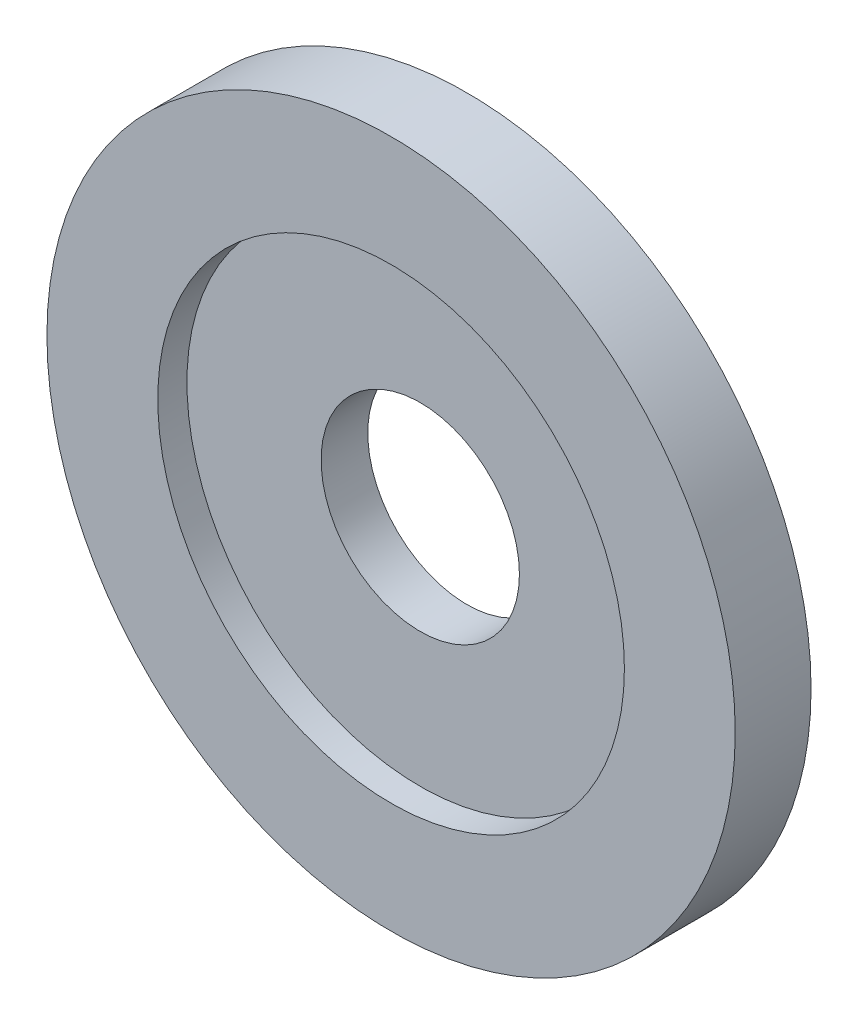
ISO-10303-21;
HEADER;
FILE_DESCRIPTION(('STEP AP214'),'2;1');
FILE_NAME('part.step','',(''),(''),'','','');
FILE_SCHEMA(('AUTOMOTIVE_DESIGN { 1 0 10303 214 1 1 1 1 }'));
ENDSEC;
DATA;
#1=APPLICATION_CONTEXT('core data for automotive mechanical design processes');
#2=APPLICATION_PROTOCOL_DEFINITION('international standard','automotive_design',2000,#1);
#3=PRODUCT_CONTEXT('',#1,'mechanical');
#4=PRODUCT('Part','Part','',(#3));
#5=PRODUCT_RELATED_PRODUCT_CATEGORY('part','',(#4));
#6=PRODUCT_DEFINITION_FORMATION('','',#4);
#7=PRODUCT_DEFINITION_CONTEXT('part definition',#1,'design');
#8=PRODUCT_DEFINITION('design','',#6,#7);
#9=PRODUCT_DEFINITION_SHAPE('','',#8);
#10=(LENGTH_UNIT() NAMED_UNIT(*) SI_UNIT(.MILLI.,.METRE.));
#11=(NAMED_UNIT(*) PLANE_ANGLE_UNIT() SI_UNIT($,.RADIAN.));
#12=(NAMED_UNIT(*) SI_UNIT($,.STERADIAN.) SOLID_ANGLE_UNIT());
#13=UNCERTAINTY_MEASURE_WITH_UNIT(LENGTH_MEASURE(1.E-05),#10,'distance_accuracy_value','');
#14=(GEOMETRIC_REPRESENTATION_CONTEXT(3) GLOBAL_UNCERTAINTY_ASSIGNED_CONTEXT((#13)) GLOBAL_UNIT_ASSIGNED_CONTEXT((#10,
#11,#12)) REPRESENTATION_CONTEXT('',''));
#15=CARTESIAN_POINT('',(0.,0.,0.));
#16=DIRECTION('',(0.,0.,1.));
#17=DIRECTION('',(1.,0.,0.));
#18=AXIS2_PLACEMENT_3D('',#15,#16,#17);
#19=CARTESIAN_POINT('',(0.,0.,6.5));
#20=DIRECTION('',(0.,0.,-1.));
#21=DIRECTION('',(-1.,0.,0.));
#22=AXIS2_PLACEMENT_3D('',#19,#20,#21);
#23=CYLINDRICAL_SURFACE('',#22,29.5);
#24=CARTESIAN_POINT('',(0.,0.,6.5));
#25=DIRECTION('',(0.,0.,1.));
#26=DIRECTION('',(1.,0.,0.));
#27=AXIS2_PLACEMENT_3D('',#24,#25,#26);
#28=CIRCLE('',#27,29.5);
#29=CARTESIAN_POINT('',(-29.5,0.,6.5));
#30=VERTEX_POINT('',#29);
#31=EDGE_CURVE('E10',#30,#30,#28,.T.);
#32=CARTESIAN_POINT('',(0.,0.,0.));
#33=DIRECTION('',(0.,0.,1.));
#34=DIRECTION('',(1.,0.,0.));
#35=AXIS2_PLACEMENT_3D('',#32,#33,#34);
#36=CIRCLE('',#35,29.5);
#37=CARTESIAN_POINT('',(-29.5,0.,0.));
#38=VERTEX_POINT('',#37);
#39=EDGE_CURVE('E35',#38,#38,#36,.T.);
#40=CARTESIAN_POINT('',(-29.5,0.,6.5));
#41=CARTESIAN_POINT('',(-29.5,0.,6.43229166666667));
#42=CARTESIAN_POINT('',(-29.5,0.,6.36458333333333));
#43=CARTESIAN_POINT('',(-29.5,0.,6.22916666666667));
#44=CARTESIAN_POINT('',(-29.5,0.,6.16145833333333));
#45=CARTESIAN_POINT('',(-29.5,0.,6.02604166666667));
#46=CARTESIAN_POINT('',(-29.5,0.,5.95833333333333));
#47=CARTESIAN_POINT('',(-29.5,0.,5.82291666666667));
#48=CARTESIAN_POINT('',(-29.5,0.,5.75520833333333));
#49=CARTESIAN_POINT('',(-29.5,0.,5.61979166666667));
#50=CARTESIAN_POINT('',(-29.5,0.,5.55208333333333));
#51=CARTESIAN_POINT('',(-29.5,0.,5.41666666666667));
#52=CARTESIAN_POINT('',(-29.5,0.,5.34895833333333));
#53=CARTESIAN_POINT('',(-29.5,0.,5.21354166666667));
#54=CARTESIAN_POINT('',(-29.5,0.,5.14583333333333));
#55=CARTESIAN_POINT('',(-29.5,0.,5.01041666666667));
#56=CARTESIAN_POINT('',(-29.5,0.,4.94270833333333));
#57=CARTESIAN_POINT('',(-29.5,0.,4.80729166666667));
#58=CARTESIAN_POINT('',(-29.5,0.,4.73958333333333));
#59=CARTESIAN_POINT('',(-29.5,0.,4.60416666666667));
#60=CARTESIAN_POINT('',(-29.5,0.,4.53645833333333));
#61=CARTESIAN_POINT('',(-29.5,0.,4.40104166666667));
#62=CARTESIAN_POINT('',(-29.5,0.,4.33333333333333));
#63=CARTESIAN_POINT('',(-29.5,0.,4.19791666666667));
#64=CARTESIAN_POINT('',(-29.5,0.,4.13020833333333));
#65=CARTESIAN_POINT('',(-29.5,0.,3.99479166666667));
#66=CARTESIAN_POINT('',(-29.5,0.,3.92708333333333));
#67=CARTESIAN_POINT('',(-29.5,0.,3.79166666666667));
#68=CARTESIAN_POINT('',(-29.5,0.,3.72395833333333));
#69=CARTESIAN_POINT('',(-29.5,0.,3.58854166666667));
#70=CARTESIAN_POINT('',(-29.5,0.,3.52083333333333));
#71=CARTESIAN_POINT('',(-29.5,0.,3.38541666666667));
#72=CARTESIAN_POINT('',(-29.5,0.,3.31770833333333));
#73=CARTESIAN_POINT('',(-29.5,0.,3.18229166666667));
#74=CARTESIAN_POINT('',(-29.5,0.,3.11458333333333));
#75=CARTESIAN_POINT('',(-29.5,0.,2.97916666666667));
#76=CARTESIAN_POINT('',(-29.5,0.,2.91145833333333));
#77=CARTESIAN_POINT('',(-29.5,0.,2.77604166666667));
#78=CARTESIAN_POINT('',(-29.5,0.,2.70833333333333));
#79=CARTESIAN_POINT('',(-29.5,0.,2.57291666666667));
#80=CARTESIAN_POINT('',(-29.5,0.,2.50520833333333));
#81=CARTESIAN_POINT('',(-29.5,0.,2.36979166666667));
#82=CARTESIAN_POINT('',(-29.5,0.,2.30208333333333));
#83=CARTESIAN_POINT('',(-29.5,0.,2.16666666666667));
#84=CARTESIAN_POINT('',(-29.5,0.,2.09895833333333));
#85=CARTESIAN_POINT('',(-29.5,0.,1.96354166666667));
#86=CARTESIAN_POINT('',(-29.5,0.,1.89583333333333));
#87=CARTESIAN_POINT('',(-29.5,0.,1.76041666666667));
#88=CARTESIAN_POINT('',(-29.5,0.,1.69270833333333));
#89=CARTESIAN_POINT('',(-29.5,0.,1.55729166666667));
#90=CARTESIAN_POINT('',(-29.5,0.,1.48958333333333));
#91=CARTESIAN_POINT('',(-29.5,0.,1.35416666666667));
#92=CARTESIAN_POINT('',(-29.5,0.,1.28645833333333));
#93=CARTESIAN_POINT('',(-29.5,0.,1.15104166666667));
#94=CARTESIAN_POINT('',(-29.5,0.,1.08333333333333));
#95=CARTESIAN_POINT('',(-29.5,0.,0.947916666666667));
#96=CARTESIAN_POINT('',(-29.5,0.,0.880208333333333));
#97=CARTESIAN_POINT('',(-29.5,0.,0.744791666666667));
#98=CARTESIAN_POINT('',(-29.5,0.,0.677083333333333));
#99=CARTESIAN_POINT('',(-29.5,0.,0.541666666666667));
#100=CARTESIAN_POINT('',(-29.5,0.,0.473958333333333));
#101=CARTESIAN_POINT('',(-29.5,0.,0.338541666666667));
#102=CARTESIAN_POINT('',(-29.5,0.,0.270833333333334));
#103=CARTESIAN_POINT('',(-29.5,0.,0.135416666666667));
#104=CARTESIAN_POINT('',(-29.5,0.,0.0677083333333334));
#105=CARTESIAN_POINT('',(-29.5,0.,0.));
#106=B_SPLINE_CURVE_WITH_KNOTS('',3,(#40,#41,#42,#43,#44,#45,#46,#47,#48,#49,#50,#51,#52,#53,
#54,#55,#56,#57,#58,#59,#60,#61,#62,#63,#64,#65,#66,#67,#68,#69,#70,#71,#72,#73,#74,#75,#76,#77,
#78,#79,#80,#81,#82,#83,#84,#85,#86,#87,#88,#89,#90,#91,#92,#93,#94,#95,#96,#97,#98,#99,#100,
#101,#102,#103,#104,#105),.UNSPECIFIED.,.F.,.F.,(4,2,2,2,2,2,2,2,2,2,2,2,2,2,2,2,2,2,2,2,2,2,2,
2,2,2,2,2,2,2,2,2,4),(0.,0.203124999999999,0.40625,0.609375,0.812499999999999,1.015625,1.21875,
1.421875,1.625,1.828125,2.03125,2.234375,2.4375,2.640625,2.84375,3.046875,3.25,3.453125,3.65625,
3.859375,4.0625,4.265625,4.46875,4.671875,4.875,5.078125,5.28125,5.484375,5.6875,5.890625,
6.09375,6.296875,6.5),.UNSPECIFIED.);
#107=EDGE_CURVE('BSEAM28',#30,#38,#106,.T.);
#108=ORIENTED_EDGE('',*,*,#31,.F.);
#109=ORIENTED_EDGE('',*,*,#39,.T.);
#110=ORIENTED_EDGE('',*,*,#107,.T.);
#111=ORIENTED_EDGE('',*,*,#107,.F.);
#112=EDGE_LOOP('',(#108,#110,#109,#111));
#113=FACE_BOUND('',#112,.T.);
#114=ADVANCED_FACE('F28',(#113),#23,.T.);
#115=CARTESIAN_POINT('',(0.,0.,6.5));
#116=DIRECTION('',(0.,0.,1.));
#117=DIRECTION('',(1.,0.,0.));
#118=AXIS2_PLACEMENT_3D('',#115,#116,#117);
#119=PLANE('',#118);
#120=CARTESIAN_POINT('',(0.,0.,6.5));
#121=DIRECTION('',(0.,0.,1.));
#122=DIRECTION('',(1.,0.,0.));
#123=AXIS2_PLACEMENT_3D('',#120,#121,#122);
#124=CIRCLE('',#123,20.);
#125=CARTESIAN_POINT('',(20.,0.,6.5));
#126=VERTEX_POINT('',#125);
#127=EDGE_CURVE('E47',#126,#126,#124,.T.);
#128=ORIENTED_EDGE('',*,*,#127,.F.);
#129=EDGE_LOOP('',(#128));
#130=FACE_BOUND('',#129,.T.);
#131=ORIENTED_EDGE('',*,*,#31,.T.);
#132=EDGE_LOOP('',(#131));
#133=FACE_BOUND('',#132,.T.);
#134=ADVANCED_FACE('F53',(#130,#133),#119,.T.);
#135=CARTESIAN_POINT('',(0.,0.,0.));
#136=DIRECTION('',(0.,0.,1.));
#137=DIRECTION('',(1.,0.,0.));
#138=AXIS2_PLACEMENT_3D('',#135,#136,#137);
#139=PLANE('',#138);
#140=CARTESIAN_POINT('',(0.,0.,0.));
#141=DIRECTION('',(0.,0.,1.));
#142=DIRECTION('',(1.,0.,0.));
#143=AXIS2_PLACEMENT_3D('',#140,#141,#142);
#144=CIRCLE('',#143,8.50000000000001);
#145=CARTESIAN_POINT('',(8.50000000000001,0.,0.));
#146=VERTEX_POINT('',#145);
#147=EDGE_CURVE('E31',#146,#146,#144,.T.);
#148=ORIENTED_EDGE('',*,*,#147,.T.);
#149=EDGE_LOOP('',(#148));
#150=FACE_BOUND('',#149,.T.);
#151=ORIENTED_EDGE('',*,*,#39,.F.);
#152=EDGE_LOOP('',(#151));
#153=FACE_BOUND('',#152,.T.);
#154=ADVANCED_FACE('F55',(#150,#153),#139,.F.);
#155=CARTESIAN_POINT('',(0.,0.,6.5));
#156=DIRECTION('',(0.,0.,1.));
#157=DIRECTION('',(1.,0.,0.));
#158=AXIS2_PLACEMENT_3D('',#155,#156,#157);
#159=CYLINDRICAL_SURFACE('',#158,8.50000000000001);
#160=CARTESIAN_POINT('',(0.,0.,4.));
#161=DIRECTION('',(0.,0.,1.));
#162=DIRECTION('',(1.,0.,0.));
#163=AXIS2_PLACEMENT_3D('',#160,#161,#162);
#164=CIRCLE('',#163,8.50000000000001);
#165=CARTESIAN_POINT('',(8.50000000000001,0.,4.));
#166=VERTEX_POINT('',#165);
#167=EDGE_CURVE('E41',#166,#166,#164,.T.);
#168=ORIENTED_EDGE('',*,*,#167,.T.);
#169=EDGE_LOOP('',(#168));
#170=FACE_BOUND('',#169,.T.);
#171=ORIENTED_EDGE('',*,*,#147,.F.);
#172=EDGE_LOOP('',(#171));
#173=FACE_BOUND('',#172,.T.);
#174=ADVANCED_FACE('F61',(#170,#173),#159,.F.);
#175=CARTESIAN_POINT('',(8.50000000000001,0.,4.));
#176=DIRECTION('',(0.,0.,-1.));
#177=DIRECTION('',(-1.,0.,0.));
#178=AXIS2_PLACEMENT_3D('',#175,#176,#177);
#179=PLANE('',#178);
#180=ORIENTED_EDGE('',*,*,#167,.F.);
#181=EDGE_LOOP('',(#180));
#182=FACE_BOUND('',#181,.T.);
#183=CARTESIAN_POINT('',(0.,0.,4.));
#184=DIRECTION('',(0.,0.,1.));
#185=DIRECTION('',(1.,0.,0.));
#186=AXIS2_PLACEMENT_3D('',#183,#184,#185);
#187=CIRCLE('',#186,20.);
#188=CARTESIAN_POINT('',(20.,0.,4.));
#189=VERTEX_POINT('',#188);
#190=EDGE_CURVE('E44',#189,#189,#187,.T.);
#191=ORIENTED_EDGE('',*,*,#190,.T.);
#192=EDGE_LOOP('',(#191));
#193=FACE_BOUND('',#192,.T.);
#194=ADVANCED_FACE('F67',(#182,#193),#179,.F.);
#195=CARTESIAN_POINT('',(0.,0.,6.5));
#196=DIRECTION('',(0.,0.,1.));
#197=DIRECTION('',(1.,0.,0.));
#198=AXIS2_PLACEMENT_3D('',#195,#196,#197);
#199=CYLINDRICAL_SURFACE('',#198,20.);
#200=ORIENTED_EDGE('',*,*,#190,.F.);
#201=EDGE_LOOP('',(#200));
#202=FACE_BOUND('',#201,.T.);
#203=ORIENTED_EDGE('',*,*,#127,.T.);
#204=EDGE_LOOP('',(#203));
#205=FACE_BOUND('',#204,.T.);
#206=ADVANCED_FACE('F51',(#202,#205),#199,.F.);
#207=CLOSED_SHELL('',(#114,#134,#154,#174,#194,#206));
#208=MANIFOLD_SOLID_BREP('B2',#207);
#209=ADVANCED_BREP_SHAPE_REPRESENTATION('',(#18,#208),#14);
#210=SHAPE_DEFINITION_REPRESENTATION(#9,#209);
ENDSEC;
END-ISO-10303-21;
